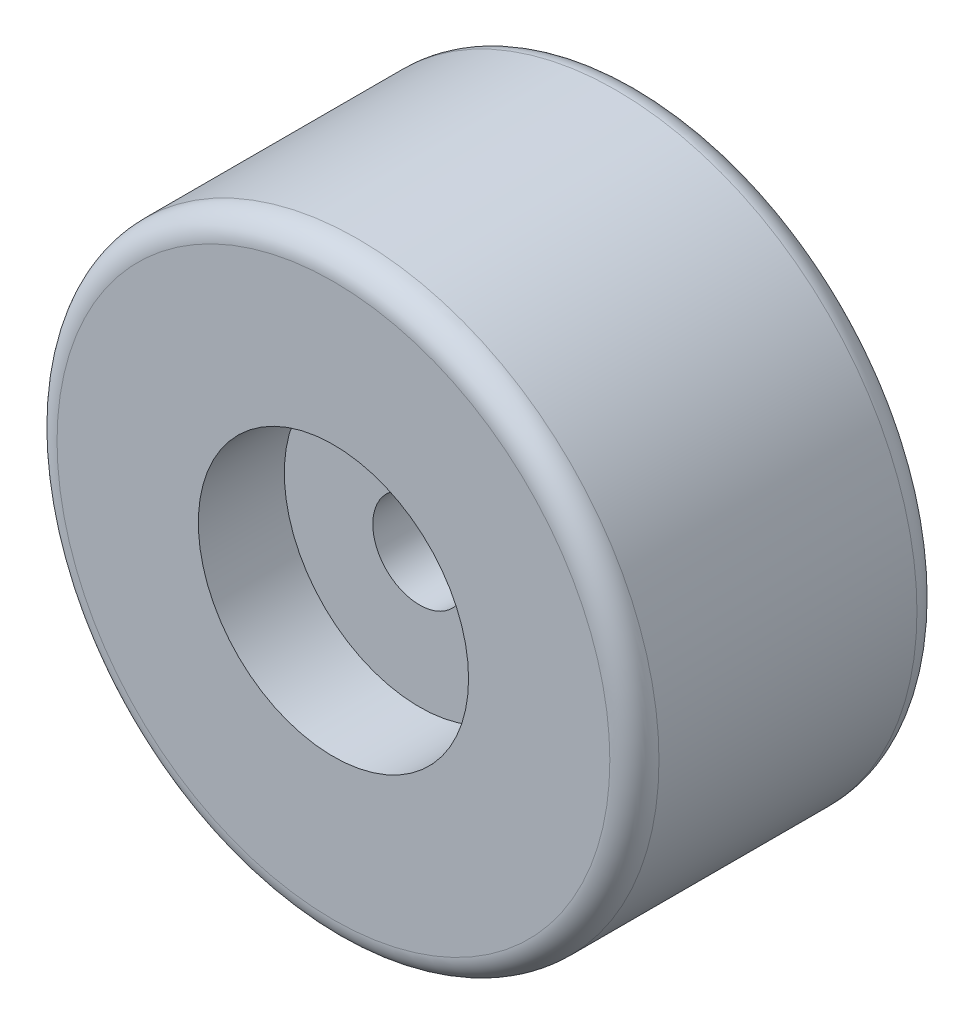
from build123d import *

# Parameters (mm, degrees)
SKETCH1_R          = 31.115
SKETCH1_R_2        = 4.826
EXTRUDE1_DEPTH     = 31.75
FILLET1_R          = 2.54
SKETCH2_R          = 13.97
CUT_EXTRUDE1_DEPTH = 8.89


with BuildPart() as part:
    # Sketch1 → Extrude1 (new body)
    with BuildSketch(Plane.XY):
        Circle(SKETCH1_R)
        Circle(SKETCH1_R_2, mode=Mode.SUBTRACT)
    extrude(amount=EXTRUDE1_DEPTH)

    # Fillet1
    fillet1_edges = [part.edges().sort_by_distance(p)[0] for p in [
        (-31.115, 0, 0),
        (-31.115, 0, 31.75),
    ]]
    fillet(fillet1_edges, radius=FILLET1_R)

    # Sketch2 → Cut-Extrude1 (cut)
    with BuildSketch(Plane.XY.offset(31.75)):
        Circle(SKETCH2_R)
    extrude(amount=-CUT_EXTRUDE1_DEPTH, mode=Mode.SUBTRACT)


solid = part.part
